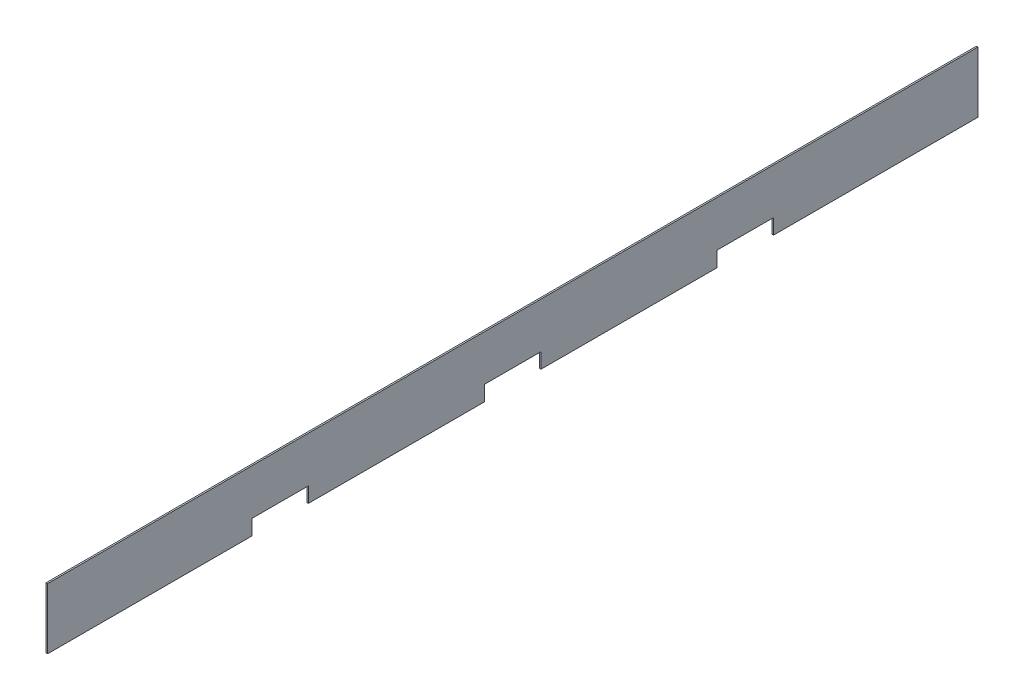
ISO-10303-21;
HEADER;
FILE_DESCRIPTION(('STEP AP214'),'2;1');
FILE_NAME('part.step','',(''),(''),'','','');
FILE_SCHEMA(('AUTOMOTIVE_DESIGN { 1 0 10303 214 1 1 1 1 }'));
ENDSEC;
DATA;
#1=APPLICATION_CONTEXT('core data for automotive mechanical design processes');
#2=APPLICATION_PROTOCOL_DEFINITION('international standard','automotive_design',2000,#1);
#3=PRODUCT_CONTEXT('',#1,'mechanical');
#4=PRODUCT('Part','Part','',(#3));
#5=PRODUCT_RELATED_PRODUCT_CATEGORY('part','',(#4));
#6=PRODUCT_DEFINITION_FORMATION('','',#4);
#7=PRODUCT_DEFINITION_CONTEXT('part definition',#1,'design');
#8=PRODUCT_DEFINITION('design','',#6,#7);
#9=PRODUCT_DEFINITION_SHAPE('','',#8);
#10=(LENGTH_UNIT() NAMED_UNIT(*) SI_UNIT(.MILLI.,.METRE.));
#11=(NAMED_UNIT(*) PLANE_ANGLE_UNIT() SI_UNIT($,.RADIAN.));
#12=(NAMED_UNIT(*) SI_UNIT($,.STERADIAN.) SOLID_ANGLE_UNIT());
#13=UNCERTAINTY_MEASURE_WITH_UNIT(LENGTH_MEASURE(1.E-05),#10,'distance_accuracy_value','');
#14=(GEOMETRIC_REPRESENTATION_CONTEXT(3) GLOBAL_UNCERTAINTY_ASSIGNED_CONTEXT((#13)) GLOBAL_UNIT_ASSIGNED_CONTEXT((#10,
#11,#12)) REPRESENTATION_CONTEXT('',''));
#15=CARTESIAN_POINT('',(0.,0.,0.));
#16=DIRECTION('',(0.,0.,1.));
#17=DIRECTION('',(1.,0.,0.));
#18=AXIS2_PLACEMENT_3D('',#15,#16,#17);
#19=CARTESIAN_POINT('',(97.5758031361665,8.63000189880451E-13,611.85928997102));
#20=DIRECTION('',(-0.00051078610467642,0.,0.999999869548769));
#21=DIRECTION('',(0.999999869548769,0.,0.00051078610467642));
#22=AXIS2_PLACEMENT_3D('',#19,#20,#21);
#23=PLANE('',#22);
#24=DIRECTION('',(0.,1.,0.));
#25=VECTOR('',#24,1.);
#26=CARTESIAN_POINT('',(96.5758032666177,8.63071807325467E-13,611.858779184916));
#27=LINE('',#26,#25);
#28=CARTESIAN_POINT('',(96.5758032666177,8.63071807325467E-13,611.858779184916));
#29=VERTEX_POINT('',#28);
#30=CARTESIAN_POINT('',(96.5758032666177,40.0000000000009,611.858779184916));
#31=VERTEX_POINT('',#30);
#32=EDGE_CURVE('E198',#29,#31,#27,.T.);
#33=ORIENTED_EDGE('',*,*,#32,.F.);
#34=DIRECTION('',(-0.999999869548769,0.,-0.00051078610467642));
#35=VECTOR('',#34,1.);
#36=CARTESIAN_POINT('',(97.5758031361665,8.63000189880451E-13,611.85928997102));
#37=LINE('',#36,#35);
#38=CARTESIAN_POINT('',(97.5758031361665,8.63000189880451E-13,611.85928997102));
#39=VERTEX_POINT('',#38);
#40=EDGE_CURVE('E13',#39,#29,#37,.T.);
#41=ORIENTED_EDGE('',*,*,#40,.F.);
#42=DIRECTION('',(0.,1.,0.));
#43=VECTOR('',#42,1.);
#44=CARTESIAN_POINT('',(97.5758031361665,8.63000189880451E-13,611.85928997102));
#45=LINE('',#44,#43);
#46=CARTESIAN_POINT('',(97.5758031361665,40.0000000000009,611.85928997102));
#47=VERTEX_POINT('',#46);
#48=EDGE_CURVE('E239',#39,#47,#45,.T.);
#49=ORIENTED_EDGE('',*,*,#48,.T.);
#50=DIRECTION('',(-0.999999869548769,0.,-0.00051078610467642));
#51=VECTOR('',#50,1.);
#52=CARTESIAN_POINT('',(97.5758031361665,40.0000000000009,611.85928997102));
#53=LINE('',#52,#51);
#54=EDGE_CURVE('E71',#47,#31,#53,.T.);
#55=ORIENTED_EDGE('',*,*,#54,.T.);
#56=EDGE_LOOP('',(#33,#41,#49,#55));
#57=FACE_BOUND('',#56,.T.);
#58=ADVANCED_FACE('F55',(#57),#23,.T.);
#59=CARTESIAN_POINT('',(97.5758031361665,8.63000189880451E-13,611.85928997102));
#60=DIRECTION('',(0.,1.,0.));
#61=DIRECTION('',(0.,0.,1.));
#62=AXIS2_PLACEMENT_3D('',#59,#60,#61);
#63=PLANE('',#62);
#64=DIRECTION('',(0.000510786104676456,0.,-0.999999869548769));
#65=VECTOR('',#64,1.);
#66=CARTESIAN_POINT('',(96.5758032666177,8.63071807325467E-13,611.858779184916));
#67=LINE('',#66,#65);
#68=CARTESIAN_POINT('',(96.6444407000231,8.08804213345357E-13,477.482718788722));
#69=VERTEX_POINT('',#68);
#70=EDGE_CURVE('E200',#29,#69,#67,.T.);
#71=ORIENTED_EDGE('',*,*,#70,.T.);
#72=DIRECTION('',(-0.999999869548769,0.,-0.00051078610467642));
#73=VECTOR('',#72,1.);
#74=CARTESIAN_POINT('',(97.6444405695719,8.0873259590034E-13,477.483229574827));
#75=LINE('',#74,#73);
#76=CARTESIAN_POINT('',(97.6444405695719,8.0873259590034E-13,477.483229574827));
#77=VERTEX_POINT('',#76);
#78=EDGE_CURVE('E63',#77,#69,#75,.T.);
#79=ORIENTED_EDGE('',*,*,#78,.F.);
#80=DIRECTION('',(0.000510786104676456,0.,-0.999999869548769));
#81=VECTOR('',#80,1.);
#82=CARTESIAN_POINT('',(97.5758031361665,8.63000189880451E-13,611.85928997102));
#83=LINE('',#82,#81);
#84=EDGE_CURVE('E285',#39,#77,#83,.T.);
#85=ORIENTED_EDGE('',*,*,#84,.F.);
#86=ORIENTED_EDGE('',*,*,#40,.T.);
#87=EDGE_LOOP('',(#71,#79,#85,#86));
#88=FACE_BOUND('',#87,.T.);
#89=ADVANCED_FACE('F273',(#88),#63,.F.);
#90=CARTESIAN_POINT('',(97.6444405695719,10.0000000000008,477.483229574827));
#91=DIRECTION('',(0.00051078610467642,0.,-0.999999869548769));
#92=DIRECTION('',(-0.999999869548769,0.,-0.00051078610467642));
#93=AXIS2_PLACEMENT_3D('',#90,#91,#92);
#94=PLANE('',#93);
#95=DIRECTION('',(0.,-1.,0.));
#96=VECTOR('',#95,1.);
#97=CARTESIAN_POINT('',(96.6444407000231,10.0000000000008,477.482718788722));
#98=LINE('',#97,#96);
#99=CARTESIAN_POINT('',(96.6444407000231,10.0000000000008,477.482718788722));
#100=VERTEX_POINT('',#99);
#101=EDGE_CURVE('E203',#100,#69,#98,.T.);
#102=ORIENTED_EDGE('',*,*,#101,.F.);
#103=DIRECTION('',(-0.999999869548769,0.,-0.00051078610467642));
#104=VECTOR('',#103,1.);
#105=CARTESIAN_POINT('',(97.6444405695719,10.0000000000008,477.483229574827));
#106=LINE('',#105,#104);
#107=CARTESIAN_POINT('',(97.6444405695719,10.0000000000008,477.483229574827));
#108=VERTEX_POINT('',#107);
#109=EDGE_CURVE('E263',#108,#100,#106,.T.);
#110=ORIENTED_EDGE('',*,*,#109,.F.);
#111=DIRECTION('',(0.,-1.,0.));
#112=VECTOR('',#111,1.);
#113=CARTESIAN_POINT('',(97.6444405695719,10.0000000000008,477.483229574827));
#114=LINE('',#113,#112);
#115=EDGE_CURVE('E270',#108,#77,#114,.T.);
#116=ORIENTED_EDGE('',*,*,#115,.T.);
#117=ORIENTED_EDGE('',*,*,#78,.T.);
#118=EDGE_LOOP('',(#102,#110,#116,#117));
#119=FACE_BOUND('',#118,.T.);
#120=ADVANCED_FACE('F268',(#119),#94,.T.);
#121=CARTESIAN_POINT('',(97.6633921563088,10.0000000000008,440.380449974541));
#122=DIRECTION('',(0.,-1.,0.));
#123=DIRECTION('',(0.,0.,-1.));
#124=AXIS2_PLACEMENT_3D('',#121,#122,#123);
#125=PLANE('',#124);
#126=DIRECTION('',(-0.000510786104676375,0.,0.999999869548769));
#127=VECTOR('',#126,1.);
#128=CARTESIAN_POINT('',(96.66339228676,10.0000000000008,440.379939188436));
#129=LINE('',#128,#127);
#130=CARTESIAN_POINT('',(96.66339228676,10.0000000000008,440.379939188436));
#131=VERTEX_POINT('',#130);
#132=EDGE_CURVE('E206',#131,#100,#129,.T.);
#133=ORIENTED_EDGE('',*,*,#132,.F.);
#134=DIRECTION('',(-0.999999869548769,0.,-0.00051078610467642));
#135=VECTOR('',#134,1.);
#136=CARTESIAN_POINT('',(97.6633921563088,10.0000000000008,440.380449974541));
#137=LINE('',#136,#135);
#138=CARTESIAN_POINT('',(97.6633921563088,10.0000000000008,440.380449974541));
#139=VERTEX_POINT('',#138);
#140=EDGE_CURVE('E261',#139,#131,#137,.T.);
#141=ORIENTED_EDGE('',*,*,#140,.F.);
#142=DIRECTION('',(-0.000510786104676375,0.,0.999999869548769));
#143=VECTOR('',#142,1.);
#144=CARTESIAN_POINT('',(97.6633921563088,10.0000000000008,440.380449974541));
#145=LINE('',#144,#143);
#146=EDGE_CURVE('E284',#139,#108,#145,.T.);
#147=ORIENTED_EDGE('',*,*,#146,.T.);
#148=ORIENTED_EDGE('',*,*,#109,.T.);
#149=EDGE_LOOP('',(#133,#141,#147,#148));
#150=FACE_BOUND('',#149,.T.);
#151=ADVANCED_FACE('F280',(#150),#125,.T.);
#152=CARTESIAN_POINT('',(97.6633921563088,10.0000000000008,440.380449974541));
#153=DIRECTION('',(0.00051078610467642,0.,-0.999999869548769));
#154=DIRECTION('',(-0.999999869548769,0.,-0.00051078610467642));
#155=AXIS2_PLACEMENT_3D('',#152,#153,#154);
#156=PLANE('',#155);
#157=DIRECTION('',(0.,-1.,0.));
#158=VECTOR('',#157,1.);
#159=CARTESIAN_POINT('',(96.66339228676,10.0000000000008,440.379939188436));
#160=LINE('',#159,#158);
#161=CARTESIAN_POINT('',(96.66339228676,7.5790549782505E-13,440.379939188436));
#162=VERTEX_POINT('',#161);
#163=EDGE_CURVE('E209',#131,#162,#160,.T.);
#164=ORIENTED_EDGE('',*,*,#163,.T.);
#165=DIRECTION('',(-0.999999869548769,0.,-0.00051078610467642));
#166=VECTOR('',#165,1.);
#167=CARTESIAN_POINT('',(97.6633921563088,7.57833880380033E-13,440.380449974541));
#168=LINE('',#167,#166);
#169=CARTESIAN_POINT('',(97.6633921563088,7.57833880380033E-13,440.380449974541));
#170=VERTEX_POINT('',#169);
#171=EDGE_CURVE('E258',#170,#162,#168,.T.);
#172=ORIENTED_EDGE('',*,*,#171,.F.);
#173=DIRECTION('',(0.,-1.,0.));
#174=VECTOR('',#173,1.);
#175=CARTESIAN_POINT('',(97.6633921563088,10.0000000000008,440.380449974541));
#176=LINE('',#175,#174);
#177=EDGE_CURVE('E287',#139,#170,#176,.T.);
#178=ORIENTED_EDGE('',*,*,#177,.F.);
#179=ORIENTED_EDGE('',*,*,#140,.T.);
#180=EDGE_LOOP('',(#164,#172,#178,#179));
#181=FACE_BOUND('',#180,.T.);
#182=ADVANCED_FACE('F436',(#181),#156,.F.);
#183=CARTESIAN_POINT('',(97.6633921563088,7.57665219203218E-13,440.380449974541));
#184=DIRECTION('',(0.,1.,0.));
#185=DIRECTION('',(0.,0.,1.));
#186=AXIS2_PLACEMENT_3D('',#183,#184,#185);
#187=PLANE('',#186);
#188=DIRECTION('',(0.000510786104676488,0.,-0.999999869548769));
#189=VECTOR('',#188,1.);
#190=CARTESIAN_POINT('',(96.66339228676,7.57736836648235E-13,440.379939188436));
#191=LINE('',#190,#189);
#192=CARTESIAN_POINT('',(96.7225793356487,4.89500927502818E-13,324.505523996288));
#193=VERTEX_POINT('',#192);
#194=EDGE_CURVE('E211',#162,#193,#191,.T.);
#195=ORIENTED_EDGE('',*,*,#194,.T.);
#196=DIRECTION('',(-0.999999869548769,0.,-0.00051078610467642));
#197=VECTOR('',#196,1.);
#198=CARTESIAN_POINT('',(97.7225792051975,4.89429310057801E-13,324.506034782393));
#199=LINE('',#198,#197);
#200=CARTESIAN_POINT('',(97.7225792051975,4.89429310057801E-13,324.506034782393));
#201=VERTEX_POINT('',#200);
#202=EDGE_CURVE('E256',#201,#193,#199,.T.);
#203=ORIENTED_EDGE('',*,*,#202,.F.);
#204=DIRECTION('',(0.000510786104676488,0.,-0.999999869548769));
#205=VECTOR('',#204,1.);
#206=CARTESIAN_POINT('',(97.6633921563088,7.57665219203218E-13,440.380449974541));
#207=LINE('',#206,#205);
#208=EDGE_CURVE('E293',#170,#201,#207,.T.);
#209=ORIENTED_EDGE('',*,*,#208,.F.);
#210=ORIENTED_EDGE('',*,*,#171,.T.);
#211=EDGE_LOOP('',(#195,#203,#209,#210));
#212=FACE_BOUND('',#211,.T.);
#213=ADVANCED_FACE('F426',(#212),#187,.F.);
#214=CARTESIAN_POINT('',(97.7225792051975,10.0000000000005,324.506034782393));
#215=DIRECTION('',(0.00051078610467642,0.,-0.999999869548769));
#216=DIRECTION('',(-0.999999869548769,0.,-0.00051078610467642));
#217=AXIS2_PLACEMENT_3D('',#214,#215,#216);
#218=PLANE('',#217);
#219=DIRECTION('',(0.,-1.,0.));
#220=VECTOR('',#219,1.);
#221=CARTESIAN_POINT('',(96.7225793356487,10.0000000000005,324.505523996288));
#222=LINE('',#221,#220);
#223=CARTESIAN_POINT('',(96.7225793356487,10.0000000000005,324.505523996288));
#224=VERTEX_POINT('',#223);
#225=EDGE_CURVE('E214',#224,#193,#222,.T.);
#226=ORIENTED_EDGE('',*,*,#225,.F.);
#227=DIRECTION('',(-0.999999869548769,0.,-0.00051078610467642));
#228=VECTOR('',#227,1.);
#229=CARTESIAN_POINT('',(97.7225792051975,10.0000000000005,324.506034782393));
#230=LINE('',#229,#228);
#231=CARTESIAN_POINT('',(97.7225792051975,10.0000000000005,324.506034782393));
#232=VERTEX_POINT('',#231);
#233=EDGE_CURVE('E254',#232,#224,#230,.T.);
#234=ORIENTED_EDGE('',*,*,#233,.F.);
#235=DIRECTION('',(0.,-1.,0.));
#236=VECTOR('',#235,1.);
#237=CARTESIAN_POINT('',(97.7225792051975,10.0000000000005,324.506034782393));
#238=LINE('',#237,#236);
#239=EDGE_CURVE('E295',#232,#201,#238,.T.);
#240=ORIENTED_EDGE('',*,*,#239,.T.);
#241=ORIENTED_EDGE('',*,*,#202,.T.);
#242=EDGE_LOOP('',(#226,#234,#240,#241));
#243=FACE_BOUND('',#242,.T.);
#244=ADVANCED_FACE('F416',(#243),#218,.T.);
#245=CARTESIAN_POINT('',(97.7415307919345,10.0000000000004,287.403255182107));
#246=DIRECTION('',(0.,-1.,0.));
#247=DIRECTION('',(0.,0.,-1.));
#248=AXIS2_PLACEMENT_3D('',#245,#246,#247);
#249=PLANE('',#248);
#250=DIRECTION('',(-0.000510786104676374,0.,0.999999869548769));
#251=VECTOR('',#250,1.);
#252=CARTESIAN_POINT('',(96.7415309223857,10.0000000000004,287.402744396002));
#253=LINE('',#252,#251);
#254=CARTESIAN_POINT('',(96.7415309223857,10.0000000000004,287.402744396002));
#255=VERTEX_POINT('',#254);
#256=EDGE_CURVE('E217',#255,#224,#253,.T.);
#257=ORIENTED_EDGE('',*,*,#256,.F.);
#258=DIRECTION('',(-0.999999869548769,0.,-0.00051078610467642));
#259=VECTOR('',#258,1.);
#260=CARTESIAN_POINT('',(97.7415307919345,10.0000000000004,287.403255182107));
#261=LINE('',#260,#259);
#262=CARTESIAN_POINT('',(97.7415307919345,10.0000000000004,287.403255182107));
#263=VERTEX_POINT('',#262);
#264=EDGE_CURVE('E252',#263,#255,#261,.T.);
#265=ORIENTED_EDGE('',*,*,#264,.F.);
#266=DIRECTION('',(-0.000510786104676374,0.,0.999999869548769));
#267=VECTOR('',#266,1.);
#268=CARTESIAN_POINT('',(97.7415307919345,10.0000000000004,287.403255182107));
#269=LINE('',#268,#267);
#270=EDGE_CURVE('E298',#263,#232,#269,.T.);
#271=ORIENTED_EDGE('',*,*,#270,.T.);
#272=ORIENTED_EDGE('',*,*,#233,.T.);
#273=EDGE_LOOP('',(#257,#265,#271,#272));
#274=FACE_BOUND('',#273,.T.);
#275=ADVANCED_FACE('F406',(#274),#249,.T.);
#276=CARTESIAN_POINT('',(97.7415307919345,10.0000000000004,287.403255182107));
#277=DIRECTION('',(0.00051078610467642,0.,-0.999999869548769));
#278=DIRECTION('',(-0.999999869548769,0.,-0.00051078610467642));
#279=AXIS2_PLACEMENT_3D('',#276,#277,#278);
#280=PLANE('',#279);
#281=DIRECTION('',(0.,-1.,0.));
#282=VECTOR('',#281,1.);
#283=CARTESIAN_POINT('',(96.7415309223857,10.0000000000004,287.402744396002));
#284=LINE('',#283,#282);
#285=CARTESIAN_POINT('',(96.7415309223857,3.8699154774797E-13,287.402744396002));
#286=VERTEX_POINT('',#285);
#287=EDGE_CURVE('E220',#255,#286,#284,.T.);
#288=ORIENTED_EDGE('',*,*,#287,.T.);
#289=DIRECTION('',(-0.999999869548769,0.,-0.00051078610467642));
#290=VECTOR('',#289,1.);
#291=CARTESIAN_POINT('',(97.7415307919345,3.86919930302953E-13,287.403255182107));
#292=LINE('',#291,#290);
#293=CARTESIAN_POINT('',(97.7415307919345,3.86919930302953E-13,287.403255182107));
#294=VERTEX_POINT('',#293);
#295=EDGE_CURVE('E249',#294,#286,#292,.T.);
#296=ORIENTED_EDGE('',*,*,#295,.F.);
#297=DIRECTION('',(0.,-1.,0.));
#298=VECTOR('',#297,1.);
#299=CARTESIAN_POINT('',(97.7415307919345,10.0000000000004,287.403255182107));
#300=LINE('',#299,#298);
#301=EDGE_CURVE('E301',#263,#294,#300,.T.);
#302=ORIENTED_EDGE('',*,*,#301,.F.);
#303=ORIENTED_EDGE('',*,*,#264,.T.);
#304=EDGE_LOOP('',(#288,#296,#302,#303));
#305=FACE_BOUND('',#304,.T.);
#306=ADVANCED_FACE('F396',(#305),#280,.F.);
#307=CARTESIAN_POINT('',(97.7415307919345,3.87068142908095E-13,287.403255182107));
#308=DIRECTION('',(0.,1.,0.));
#309=DIRECTION('',(0.,0.,1.));
#310=AXIS2_PLACEMENT_3D('',#307,#308,#309);
#311=PLANE('',#310);
#312=DIRECTION('',(0.00051078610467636,0.,-0.999999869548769));
#313=VECTOR('',#312,1.);
#314=CARTESIAN_POINT('',(96.7415309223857,3.87139760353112E-13,287.402744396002));
#315=LINE('',#314,#313);
#316=CARTESIAN_POINT('',(96.8007179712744,1.19454339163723E-13,171.528329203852));
#317=VERTEX_POINT('',#316);
#318=EDGE_CURVE('E222',#286,#317,#315,.T.);
#319=ORIENTED_EDGE('',*,*,#318,.T.);
#320=DIRECTION('',(-0.999999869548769,0.,-0.00051078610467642));
#321=VECTOR('',#320,1.);
#322=CARTESIAN_POINT('',(97.8007178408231,1.19382721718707E-13,171.528839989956));
#323=LINE('',#322,#321);
#324=CARTESIAN_POINT('',(97.8007178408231,1.19382721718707E-13,171.528839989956));
#325=VERTEX_POINT('',#324);
#326=EDGE_CURVE('E247',#325,#317,#323,.T.);
#327=ORIENTED_EDGE('',*,*,#326,.F.);
#328=DIRECTION('',(0.00051078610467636,0.,-0.999999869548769));
#329=VECTOR('',#328,1.);
#330=CARTESIAN_POINT('',(97.7415307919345,3.87068142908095E-13,287.403255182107));
#331=LINE('',#330,#329);
#332=EDGE_CURVE('E303',#294,#325,#331,.T.);
#333=ORIENTED_EDGE('',*,*,#332,.F.);
#334=ORIENTED_EDGE('',*,*,#295,.T.);
#335=EDGE_LOOP('',(#319,#327,#333,#334));
#336=FACE_BOUND('',#335,.T.);
#337=ADVANCED_FACE('F387',(#336),#311,.F.);
#338=CARTESIAN_POINT('',(97.8007178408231,10.0000000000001,171.528839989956));
#339=DIRECTION('',(0.00051078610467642,0.,-0.999999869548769));
#340=DIRECTION('',(-0.999999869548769,0.,-0.00051078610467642));
#341=AXIS2_PLACEMENT_3D('',#338,#339,#340);
#342=PLANE('',#341);
#343=DIRECTION('',(0.,-1.,0.));
#344=VECTOR('',#343,1.);
#345=CARTESIAN_POINT('',(96.8007179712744,10.0000000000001,171.528329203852));
#346=LINE('',#345,#344);
#347=CARTESIAN_POINT('',(96.8007179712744,10.0000000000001,171.528329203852));
#348=VERTEX_POINT('',#347);
#349=EDGE_CURVE('E225',#348,#317,#346,.T.);
#350=ORIENTED_EDGE('',*,*,#349,.F.);
#351=DIRECTION('',(-0.999999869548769,0.,-0.00051078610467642));
#352=VECTOR('',#351,1.);
#353=CARTESIAN_POINT('',(97.8007178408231,10.0000000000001,171.528839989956));
#354=LINE('',#353,#352);
#355=CARTESIAN_POINT('',(97.8007178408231,10.0000000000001,171.528839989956));
#356=VERTEX_POINT('',#355);
#357=EDGE_CURVE('E245',#356,#348,#354,.T.);
#358=ORIENTED_EDGE('',*,*,#357,.F.);
#359=DIRECTION('',(0.,-1.,0.));
#360=VECTOR('',#359,1.);
#361=CARTESIAN_POINT('',(97.8007178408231,10.0000000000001,171.528839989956));
#362=LINE('',#361,#360);
#363=EDGE_CURVE('E305',#356,#325,#362,.T.);
#364=ORIENTED_EDGE('',*,*,#363,.T.);
#365=ORIENTED_EDGE('',*,*,#326,.T.);
#366=EDGE_LOOP('',(#350,#358,#364,#365));
#367=FACE_BOUND('',#366,.T.);
#368=ADVANCED_FACE('F318',(#367),#342,.T.);
#369=CARTESIAN_POINT('',(97.8196694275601,10.0000000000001,134.426060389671));
#370=DIRECTION('',(0.,-1.,0.));
#371=DIRECTION('',(0.,0.,-1.));
#372=AXIS2_PLACEMENT_3D('',#369,#370,#371);
#373=PLANE('',#372);
#374=DIRECTION('',(-0.000510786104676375,0.,0.999999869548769));
#375=VECTOR('',#374,1.);
#376=CARTESIAN_POINT('',(96.8196695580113,10.0000000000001,134.425549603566));
#377=LINE('',#376,#375);
#378=CARTESIAN_POINT('',(96.8196695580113,10.0000000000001,134.425549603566));
#379=VERTEX_POINT('',#378);
#380=EDGE_CURVE('E228',#379,#348,#377,.T.);
#381=ORIENTED_EDGE('',*,*,#380,.F.);
#382=DIRECTION('',(-0.999999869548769,0.,-0.00051078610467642));
#383=VECTOR('',#382,1.);
#384=CARTESIAN_POINT('',(97.8196694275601,10.0000000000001,134.426060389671));
#385=LINE('',#384,#383);
#386=CARTESIAN_POINT('',(97.8196694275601,10.0000000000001,134.426060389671));
#387=VERTEX_POINT('',#386);
#388=EDGE_CURVE('E243',#387,#379,#385,.T.);
#389=ORIENTED_EDGE('',*,*,#388,.F.);
#390=DIRECTION('',(-0.000510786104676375,0.,0.999999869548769));
#391=VECTOR('',#390,1.);
#392=CARTESIAN_POINT('',(97.8196694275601,10.0000000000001,134.426060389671));
#393=LINE('',#392,#391);
#394=EDGE_CURVE('E308',#387,#356,#393,.T.);
#395=ORIENTED_EDGE('',*,*,#394,.T.);
#396=ORIENTED_EDGE('',*,*,#357,.T.);
#397=EDGE_LOOP('',(#381,#389,#395,#396));
#398=FACE_BOUND('',#397,.T.);
#399=ADVANCED_FACE('F312',(#398),#373,.T.);
#400=CARTESIAN_POINT('',(97.8196694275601,10.0000000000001,134.426060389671));
#401=DIRECTION('',(0.00051078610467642,0.,-0.999999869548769));
#402=DIRECTION('',(-0.999999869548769,0.,-0.00051078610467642));
#403=AXIS2_PLACEMENT_3D('',#400,#401,#402);
#404=PLANE('',#403);
#405=DIRECTION('',(0.,-1.,0.));
#406=VECTOR('',#405,1.);
#407=CARTESIAN_POINT('',(96.8196695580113,10.0000000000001,134.425549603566));
#408=LINE('',#407,#406);
#409=CARTESIAN_POINT('',(96.8196695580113,0.,134.425549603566));
#410=VERTEX_POINT('',#409);
#411=EDGE_CURVE('E231',#379,#410,#408,.T.);
#412=ORIENTED_EDGE('',*,*,#411,.T.);
#413=DIRECTION('',(-0.999999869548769,0.,-0.00051078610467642));
#414=VECTOR('',#413,1.);
#415=CARTESIAN_POINT('',(97.8196694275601,0.,134.426060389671));
#416=LINE('',#415,#414);
#417=CARTESIAN_POINT('',(97.8196694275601,0.,134.426060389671));
#418=VERTEX_POINT('',#417);
#419=EDGE_CURVE('E190',#418,#410,#416,.T.);
#420=ORIENTED_EDGE('',*,*,#419,.F.);
#421=DIRECTION('',(0.,-1.,0.));
#422=VECTOR('',#421,1.);
#423=CARTESIAN_POINT('',(97.8196694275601,10.0000000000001,134.426060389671));
#424=LINE('',#423,#422);
#425=EDGE_CURVE('E178',#387,#418,#424,.T.);
#426=ORIENTED_EDGE('',*,*,#425,.F.);
#427=ORIENTED_EDGE('',*,*,#388,.T.);
#428=EDGE_LOOP('',(#412,#420,#426,#427));
#429=FACE_BOUND('',#428,.T.);
#430=ADVANCED_FACE('F322',(#429),#404,.F.);
#431=CARTESIAN_POINT('',(97.8196694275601,0.,134.426060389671));
#432=DIRECTION('',(0.,1.,0.));
#433=DIRECTION('',(0.,0.,1.));
#434=AXIS2_PLACEMENT_3D('',#431,#432,#433);
#435=PLANE('',#434);
#436=DIRECTION('',(0.000510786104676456,0.,-0.999999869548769));
#437=VECTOR('',#436,1.);
#438=CARTESIAN_POINT('',(96.8196695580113,0.,134.425549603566));
#439=LINE('',#438,#437);
#440=CARTESIAN_POINT('',(96.8883069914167,0.,0.0494892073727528));
#441=VERTEX_POINT('',#440);
#442=EDGE_CURVE('E187',#410,#441,#439,.T.);
#443=ORIENTED_EDGE('',*,*,#442,.T.);
#444=DIRECTION('',(-0.999999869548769,0.,-0.00051078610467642));
#445=VECTOR('',#444,1.);
#446=CARTESIAN_POINT('',(97.8883068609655,0.,0.0499999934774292));
#447=LINE('',#446,#445);
#448=CARTESIAN_POINT('',(97.8883068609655,0.,0.0499999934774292));
#449=VERTEX_POINT('',#448);
#450=EDGE_CURVE('E184',#449,#441,#447,.T.);
#451=ORIENTED_EDGE('',*,*,#450,.F.);
#452=DIRECTION('',(0.000510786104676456,0.,-0.999999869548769));
#453=VECTOR('',#452,1.);
#454=CARTESIAN_POINT('',(97.8196694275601,0.,134.426060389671));
#455=LINE('',#454,#453);
#456=EDGE_CURVE('E169',#418,#449,#455,.T.);
#457=ORIENTED_EDGE('',*,*,#456,.F.);
#458=ORIENTED_EDGE('',*,*,#419,.T.);
#459=EDGE_LOOP('',(#443,#451,#457,#458));
#460=FACE_BOUND('',#459,.T.);
#461=ADVANCED_FACE('F185',(#460),#435,.F.);
#462=CARTESIAN_POINT('',(97.8883068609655,40.,0.0499999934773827));
#463=DIRECTION('',(0.00051078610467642,0.,-0.999999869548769));
#464=DIRECTION('',(-0.999999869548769,0.,-0.00051078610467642));
#465=AXIS2_PLACEMENT_3D('',#462,#463,#464);
#466=PLANE('',#465);
#467=DIRECTION('',(0.,-1.,0.));
#468=VECTOR('',#467,1.);
#469=CARTESIAN_POINT('',(96.8883069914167,40.,0.0494892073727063));
#470=LINE('',#469,#468);
#471=CARTESIAN_POINT('',(96.8883069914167,40.,0.0494892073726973));
#472=VERTEX_POINT('',#471);
#473=EDGE_CURVE('E234',#472,#441,#470,.T.);
#474=ORIENTED_EDGE('',*,*,#473,.F.);
#475=DIRECTION('',(-0.999999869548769,0.,-0.00051078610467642));
#476=VECTOR('',#475,1.);
#477=CARTESIAN_POINT('',(97.8883068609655,40.,0.0499999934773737));
#478=LINE('',#477,#476);
#479=CARTESIAN_POINT('',(97.8883068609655,40.,0.0499999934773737));
#480=VERTEX_POINT('',#479);
#481=EDGE_CURVE('E120',#480,#472,#478,.T.);
#482=ORIENTED_EDGE('',*,*,#481,.F.);
#483=DIRECTION('',(0.,-1.,0.));
#484=VECTOR('',#483,1.);
#485=CARTESIAN_POINT('',(97.8883068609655,40.,0.0499999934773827));
#486=LINE('',#485,#484);
#487=EDGE_CURVE('E175',#480,#449,#486,.T.);
#488=ORIENTED_EDGE('',*,*,#487,.T.);
#489=ORIENTED_EDGE('',*,*,#450,.T.);
#490=EDGE_LOOP('',(#474,#482,#488,#489));
#491=FACE_BOUND('',#490,.T.);
#492=ADVANCED_FACE('F192',(#491),#466,.T.);
#493=CARTESIAN_POINT('',(97.5758031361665,40.0000000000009,611.85928997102));
#494=DIRECTION('',(0.,1.,0.));
#495=DIRECTION('',(0.,0.,1.));
#496=AXIS2_PLACEMENT_3D('',#493,#494,#495);
#497=PLANE('',#496);
#498=DIRECTION('',(0.000510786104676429,0.,-0.999999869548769));
#499=VECTOR('',#498,1.);
#500=CARTESIAN_POINT('',(96.5758032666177,40.0000000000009,611.858779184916));
#501=LINE('',#500,#499);
#502=EDGE_CURVE('E236',#31,#472,#501,.T.);
#503=ORIENTED_EDGE('',*,*,#502,.F.);
#504=ORIENTED_EDGE('',*,*,#54,.F.);
#505=DIRECTION('',(0.000510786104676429,0.,-0.999999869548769));
#506=VECTOR('',#505,1.);
#507=CARTESIAN_POINT('',(97.5758031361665,40.0000000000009,611.85928997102));
#508=LINE('',#507,#506);
#509=EDGE_CURVE('E193',#47,#480,#508,.T.);
#510=ORIENTED_EDGE('',*,*,#509,.T.);
#511=ORIENTED_EDGE('',*,*,#481,.T.);
#512=EDGE_LOOP('',(#503,#504,#510,#511));
#513=FACE_BOUND('',#512,.T.);
#514=ADVANCED_FACE('F335',(#513),#497,.T.);
#515=CARTESIAN_POINT('',(98.092621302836,-400.000000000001,-399.94994782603));
#516=DIRECTION('',(0.999999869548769,0.,0.000510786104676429));
#517=DIRECTION('',(0.000510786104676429,0.,-0.999999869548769));
#518=AXIS2_PLACEMENT_3D('',#515,#516,#517);
#519=PLANE('',#518);
#520=ORIENTED_EDGE('',*,*,#48,.F.);
#521=ORIENTED_EDGE('',*,*,#84,.T.);
#522=ORIENTED_EDGE('',*,*,#115,.F.);
#523=ORIENTED_EDGE('',*,*,#146,.F.);
#524=ORIENTED_EDGE('',*,*,#177,.T.);
#525=ORIENTED_EDGE('',*,*,#208,.T.);
#526=ORIENTED_EDGE('',*,*,#239,.F.);
#527=ORIENTED_EDGE('',*,*,#270,.F.);
#528=ORIENTED_EDGE('',*,*,#301,.T.);
#529=ORIENTED_EDGE('',*,*,#332,.T.);
#530=ORIENTED_EDGE('',*,*,#363,.F.);
#531=ORIENTED_EDGE('',*,*,#394,.F.);
#532=ORIENTED_EDGE('',*,*,#425,.T.);
#533=ORIENTED_EDGE('',*,*,#456,.T.);
#534=ORIENTED_EDGE('',*,*,#487,.F.);
#535=ORIENTED_EDGE('',*,*,#509,.F.);
#536=EDGE_LOOP('',(#520,#521,#522,#523,#524,#525,#526,#527,#528,#529,#530,#531,#532,#533,#534,#535));
#537=FACE_BOUND('',#536,.T.);
#538=ADVANCED_FACE('F172',(#537),#519,.T.);
#539=CARTESIAN_POINT('',(97.0926214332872,-400.000000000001,-399.950458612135));
#540=DIRECTION('',(0.999999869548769,0.,0.000510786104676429));
#541=DIRECTION('',(0.000510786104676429,0.,-0.999999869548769));
#542=AXIS2_PLACEMENT_3D('',#539,#540,#541);
#543=PLANE('',#542);
#544=ORIENTED_EDGE('',*,*,#32,.T.);
#545=ORIENTED_EDGE('',*,*,#502,.T.);
#546=ORIENTED_EDGE('',*,*,#473,.T.);
#547=ORIENTED_EDGE('',*,*,#442,.F.);
#548=ORIENTED_EDGE('',*,*,#411,.F.);
#549=ORIENTED_EDGE('',*,*,#380,.T.);
#550=ORIENTED_EDGE('',*,*,#349,.T.);
#551=ORIENTED_EDGE('',*,*,#318,.F.);
#552=ORIENTED_EDGE('',*,*,#287,.F.);
#553=ORIENTED_EDGE('',*,*,#256,.T.);
#554=ORIENTED_EDGE('',*,*,#225,.T.);
#555=ORIENTED_EDGE('',*,*,#194,.F.);
#556=ORIENTED_EDGE('',*,*,#163,.F.);
#557=ORIENTED_EDGE('',*,*,#132,.T.);
#558=ORIENTED_EDGE('',*,*,#101,.T.);
#559=ORIENTED_EDGE('',*,*,#70,.F.);
#560=EDGE_LOOP('',(#544,#545,#546,#547,#548,#549,#550,#551,#552,#553,#554,#555,#556,#557,#558,#559));
#561=FACE_BOUND('',#560,.T.);
#562=ADVANCED_FACE('F275',(#561),#543,.F.);
#563=CLOSED_SHELL('',(#58,#89,#120,#151,#182,#213,#244,#275,#306,#337,#368,#399,#430,#461,#492,
#514,#538,#562));
#564=MANIFOLD_SOLID_BREP('B2',#563);
#565=ADVANCED_BREP_SHAPE_REPRESENTATION('',(#18,#564),#14);
#566=SHAPE_DEFINITION_REPRESENTATION(#9,#565);
ENDSEC;
END-ISO-10303-21;
